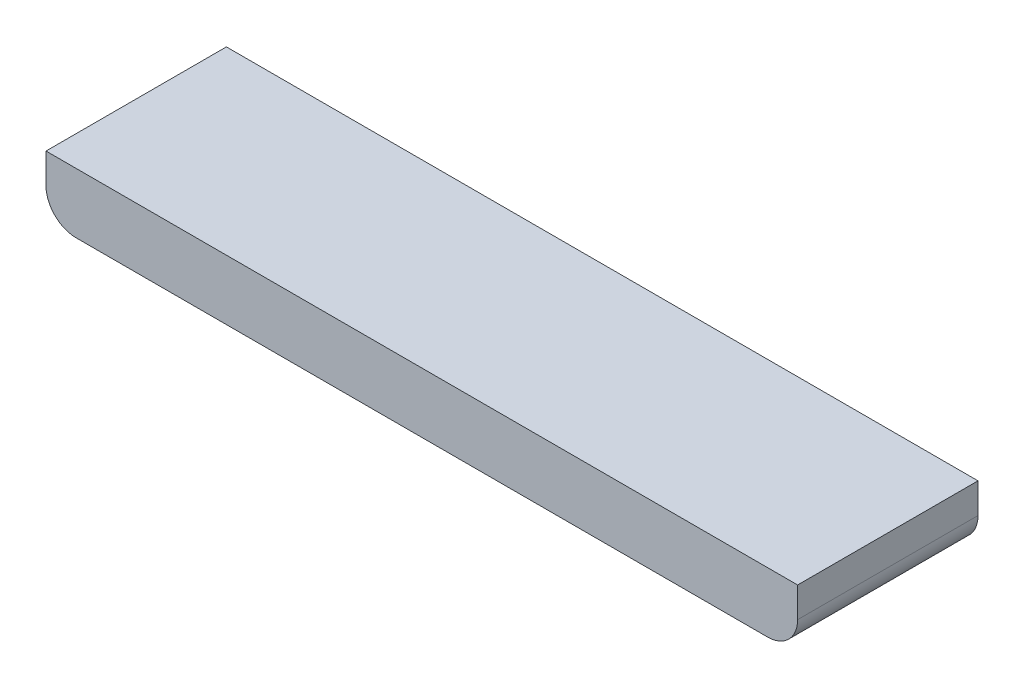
ISO-10303-21;
HEADER;
FILE_DESCRIPTION(('STEP AP214'),'2;1');
FILE_NAME('part.step','',(''),(''),'','','');
FILE_SCHEMA(('AUTOMOTIVE_DESIGN { 1 0 10303 214 1 1 1 1 }'));
ENDSEC;
DATA;
#1=APPLICATION_CONTEXT('core data for automotive mechanical design processes');
#2=APPLICATION_PROTOCOL_DEFINITION('international standard','automotive_design',2000,#1);
#3=PRODUCT_CONTEXT('',#1,'mechanical');
#4=PRODUCT('Part','Part','',(#3));
#5=PRODUCT_RELATED_PRODUCT_CATEGORY('part','',(#4));
#6=PRODUCT_DEFINITION_FORMATION('','',#4);
#7=PRODUCT_DEFINITION_CONTEXT('part definition',#1,'design');
#8=PRODUCT_DEFINITION('design','',#6,#7);
#9=PRODUCT_DEFINITION_SHAPE('','',#8);
#10=(LENGTH_UNIT() NAMED_UNIT(*) SI_UNIT(.MILLI.,.METRE.));
#11=(NAMED_UNIT(*) PLANE_ANGLE_UNIT() SI_UNIT($,.RADIAN.));
#12=(NAMED_UNIT(*) SI_UNIT($,.STERADIAN.) SOLID_ANGLE_UNIT());
#13=UNCERTAINTY_MEASURE_WITH_UNIT(LENGTH_MEASURE(1.E-05),#10,'distance_accuracy_value','');
#14=(GEOMETRIC_REPRESENTATION_CONTEXT(3) GLOBAL_UNCERTAINTY_ASSIGNED_CONTEXT((#13)) GLOBAL_UNIT_ASSIGNED_CONTEXT((#10,
#11,#12)) REPRESENTATION_CONTEXT('',''));
#15=CARTESIAN_POINT('',(0.,0.,0.));
#16=DIRECTION('',(0.,0.,1.));
#17=DIRECTION('',(1.,0.,0.));
#18=AXIS2_PLACEMENT_3D('',#15,#16,#17);
#19=CARTESIAN_POINT('',(250.,20.,-60.));
#20=DIRECTION('',(1.,0.,0.));
#21=DIRECTION('',(0.,0.,-1.));
#22=AXIS2_PLACEMENT_3D('',#19,#20,#21);
#23=PLANE('',#22);
#24=DIRECTION('',(0.,1.,0.));
#25=VECTOR('',#24,1.);
#26=CARTESIAN_POINT('',(250.,20.,60.));
#27=LINE('',#26,#25);
#28=CARTESIAN_POINT('',(250.,0.,60.));
#29=VERTEX_POINT('',#28);
#30=CARTESIAN_POINT('',(250.,20.,60.));
#31=VERTEX_POINT('',#30);
#32=EDGE_CURVE('E83',#29,#31,#27,.T.);
#33=ORIENTED_EDGE('',*,*,#32,.F.);
#34=DIRECTION('',(0.,0.,1.));
#35=VECTOR('',#34,1.);
#36=CARTESIAN_POINT('',(250.,0.,-60.));
#37=LINE('',#36,#35);
#38=CARTESIAN_POINT('',(250.,0.,-60.));
#39=VERTEX_POINT('',#38);
#40=EDGE_CURVE('E123',#29,#39,#37,.F.);
#41=ORIENTED_EDGE('',*,*,#40,.T.);
#42=DIRECTION('',(0.,1.,0.));
#43=VECTOR('',#42,1.);
#44=CARTESIAN_POINT('',(250.,20.,-60.));
#45=LINE('',#44,#43);
#46=CARTESIAN_POINT('',(250.,20.,-60.));
#47=VERTEX_POINT('',#46);
#48=EDGE_CURVE('E97',#39,#47,#45,.T.);
#49=ORIENTED_EDGE('',*,*,#48,.T.);
#50=DIRECTION('',(0.,0.,1.));
#51=VECTOR('',#50,1.);
#52=CARTESIAN_POINT('',(250.,20.,-60.));
#53=LINE('',#52,#51);
#54=EDGE_CURVE('E95',#47,#31,#53,.T.);
#55=ORIENTED_EDGE('',*,*,#54,.T.);
#56=EDGE_LOOP('',(#33,#41,#49,#55));
#57=FACE_BOUND('',#56,.T.);
#58=ADVANCED_FACE('F33',(#57),#23,.T.);
#59=CARTESIAN_POINT('',(-250.,-20.,-60.));
#60=DIRECTION('',(0.,-1.,0.));
#61=DIRECTION('',(0.,0.,-1.));
#62=AXIS2_PLACEMENT_3D('',#59,#60,#61);
#63=PLANE('',#62);
#64=DIRECTION('',(1.,0.,0.));
#65=VECTOR('',#64,1.);
#66=CARTESIAN_POINT('',(-250.,-20.,60.));
#67=LINE('',#66,#65);
#68=CARTESIAN_POINT('',(-230.,-20.,60.));
#69=VERTEX_POINT('',#68);
#70=CARTESIAN_POINT('',(230.,-20.,60.));
#71=VERTEX_POINT('',#70);
#72=EDGE_CURVE('E107',#69,#71,#67,.T.);
#73=ORIENTED_EDGE('',*,*,#72,.F.);
#74=DIRECTION('',(0.,0.,1.));
#75=VECTOR('',#74,1.);
#76=CARTESIAN_POINT('',(-230.,-20.,-60.));
#77=LINE('',#76,#75);
#78=CARTESIAN_POINT('',(-230.,-20.,-60.));
#79=VERTEX_POINT('',#78);
#80=EDGE_CURVE('E41',#69,#79,#77,.F.);
#81=ORIENTED_EDGE('',*,*,#80,.T.);
#82=DIRECTION('',(1.,0.,0.));
#83=VECTOR('',#82,1.);
#84=CARTESIAN_POINT('',(-250.,-20.,-60.));
#85=LINE('',#84,#83);
#86=CARTESIAN_POINT('',(230.,-20.,-60.));
#87=VERTEX_POINT('',#86);
#88=EDGE_CURVE('E102',#79,#87,#85,.T.);
#89=ORIENTED_EDGE('',*,*,#88,.T.);
#90=DIRECTION('',(0.,0.,1.));
#91=VECTOR('',#90,1.);
#92=CARTESIAN_POINT('',(230.,-20.,-60.));
#93=LINE('',#92,#91);
#94=EDGE_CURVE('E118',#87,#71,#93,.T.);
#95=ORIENTED_EDGE('',*,*,#94,.T.);
#96=EDGE_LOOP('',(#73,#81,#89,#95));
#97=FACE_BOUND('',#96,.T.);
#98=ADVANCED_FACE('F141',(#97),#63,.T.);
#99=CARTESIAN_POINT('',(-250.,20.,-60.));
#100=DIRECTION('',(-1.,0.,0.));
#101=DIRECTION('',(0.,0.,1.));
#102=AXIS2_PLACEMENT_3D('',#99,#100,#101);
#103=PLANE('',#102);
#104=DIRECTION('',(0.,-1.,0.));
#105=VECTOR('',#104,1.);
#106=CARTESIAN_POINT('',(-250.,20.,-60.));
#107=LINE('',#106,#105);
#108=CARTESIAN_POINT('',(-250.,20.,-60.));
#109=VERTEX_POINT('',#108);
#110=CARTESIAN_POINT('',(-250.,0.,-60.));
#111=VERTEX_POINT('',#110);
#112=EDGE_CURVE('E114',#109,#111,#107,.T.);
#113=ORIENTED_EDGE('',*,*,#112,.T.);
#114=DIRECTION('',(0.,0.,1.));
#115=VECTOR('',#114,1.);
#116=CARTESIAN_POINT('',(-250.,0.,-60.));
#117=LINE('',#116,#115);
#118=CARTESIAN_POINT('',(-250.,0.,60.));
#119=VERTEX_POINT('',#118);
#120=EDGE_CURVE('E128',#111,#119,#117,.T.);
#121=ORIENTED_EDGE('',*,*,#120,.T.);
#122=DIRECTION('',(0.,-1.,0.));
#123=VECTOR('',#122,1.);
#124=CARTESIAN_POINT('',(-250.,20.,60.));
#125=LINE('',#124,#123);
#126=CARTESIAN_POINT('',(-250.,20.,60.));
#127=VERTEX_POINT('',#126);
#128=EDGE_CURVE('E105',#127,#119,#125,.T.);
#129=ORIENTED_EDGE('',*,*,#128,.F.);
#130=DIRECTION('',(0.,0.,1.));
#131=VECTOR('',#130,1.);
#132=CARTESIAN_POINT('',(-250.,20.,-60.));
#133=LINE('',#132,#131);
#134=EDGE_CURVE('E101',#109,#127,#133,.T.);
#135=ORIENTED_EDGE('',*,*,#134,.F.);
#136=EDGE_LOOP('',(#113,#121,#129,#135));
#137=FACE_BOUND('',#136,.T.);
#138=ADVANCED_FACE('F133',(#137),#103,.T.);
#139=CARTESIAN_POINT('',(-250.,20.,-60.));
#140=DIRECTION('',(0.,1.,0.));
#141=DIRECTION('',(0.,0.,1.));
#142=AXIS2_PLACEMENT_3D('',#139,#140,#141);
#143=PLANE('',#142);
#144=ORIENTED_EDGE('',*,*,#134,.T.);
#145=DIRECTION('',(-1.,0.,0.));
#146=VECTOR('',#145,1.);
#147=CARTESIAN_POINT('',(-250.,20.,60.));
#148=LINE('',#147,#146);
#149=EDGE_CURVE('E87',#31,#127,#148,.T.);
#150=ORIENTED_EDGE('',*,*,#149,.F.);
#151=ORIENTED_EDGE('',*,*,#54,.F.);
#152=DIRECTION('',(-1.,0.,0.));
#153=VECTOR('',#152,1.);
#154=CARTESIAN_POINT('',(-250.,20.,-60.));
#155=LINE('',#154,#153);
#156=EDGE_CURVE('E112',#47,#109,#155,.T.);
#157=ORIENTED_EDGE('',*,*,#156,.T.);
#158=EDGE_LOOP('',(#144,#150,#151,#157));
#159=FACE_BOUND('',#158,.T.);
#160=ADVANCED_FACE('F104',(#159),#143,.T.);
#161=CARTESIAN_POINT('',(0.,0.,-60.));
#162=DIRECTION('',(0.,0.,1.));
#163=DIRECTION('',(1.,0.,0.));
#164=AXIS2_PLACEMENT_3D('',#161,#162,#163);
#165=PLANE('',#164);
#166=ORIENTED_EDGE('',*,*,#88,.F.);
#167=CARTESIAN_POINT('',(-230.,0.,-60.));
#168=DIRECTION('',(0.,0.,1.));
#169=DIRECTION('',(1.,0.,0.));
#170=AXIS2_PLACEMENT_3D('',#167,#168,#169);
#171=CIRCLE('',#170,20.);
#172=EDGE_CURVE('E11',#79,#111,#171,.F.);
#173=ORIENTED_EDGE('',*,*,#172,.T.);
#174=ORIENTED_EDGE('',*,*,#112,.F.);
#175=ORIENTED_EDGE('',*,*,#156,.F.);
#176=ORIENTED_EDGE('',*,*,#48,.F.);
#177=CARTESIAN_POINT('',(230.,0.,-60.));
#178=DIRECTION('',(0.,0.,1.));
#179=DIRECTION('',(1.,0.,0.));
#180=AXIS2_PLACEMENT_3D('',#177,#178,#179);
#181=CIRCLE('',#180,20.);
#182=EDGE_CURVE('E125',#39,#87,#181,.F.);
#183=ORIENTED_EDGE('',*,*,#182,.T.);
#184=EDGE_LOOP('',(#166,#173,#174,#175,#176,#183));
#185=FACE_BOUND('',#184,.T.);
#186=ADVANCED_FACE('F138',(#185),#165,.F.);
#187=CARTESIAN_POINT('',(0.,0.,60.));
#188=DIRECTION('',(0.,0.,1.));
#189=DIRECTION('',(1.,0.,0.));
#190=AXIS2_PLACEMENT_3D('',#187,#188,#189);
#191=PLANE('',#190);
#192=ORIENTED_EDGE('',*,*,#128,.T.);
#193=CARTESIAN_POINT('',(-230.,0.,60.));
#194=DIRECTION('',(0.,0.,1.));
#195=DIRECTION('',(1.,0.,0.));
#196=AXIS2_PLACEMENT_3D('',#193,#194,#195);
#197=CIRCLE('',#196,20.);
#198=EDGE_CURVE('E55',#119,#69,#197,.T.);
#199=ORIENTED_EDGE('',*,*,#198,.T.);
#200=ORIENTED_EDGE('',*,*,#72,.T.);
#201=CARTESIAN_POINT('',(230.,0.,60.));
#202=DIRECTION('',(0.,0.,1.));
#203=DIRECTION('',(1.,0.,0.));
#204=AXIS2_PLACEMENT_3D('',#201,#202,#203);
#205=CIRCLE('',#204,20.);
#206=EDGE_CURVE('E90',#71,#29,#205,.T.);
#207=ORIENTED_EDGE('',*,*,#206,.T.);
#208=ORIENTED_EDGE('',*,*,#32,.T.);
#209=ORIENTED_EDGE('',*,*,#149,.T.);
#210=EDGE_LOOP('',(#192,#199,#200,#207,#208,#209));
#211=FACE_BOUND('',#210,.T.);
#212=ADVANCED_FACE('F85',(#211),#191,.T.);
#213=CARTESIAN_POINT('',(230.,0.,-60.));
#214=DIRECTION('',(0.,0.,1.));
#215=DIRECTION('',(1.,0.,0.));
#216=AXIS2_PLACEMENT_3D('',#213,#214,#215);
#217=CYLINDRICAL_SURFACE('',#216,20.);
#218=ORIENTED_EDGE('',*,*,#182,.F.);
#219=ORIENTED_EDGE('',*,*,#40,.F.);
#220=ORIENTED_EDGE('',*,*,#206,.F.);
#221=ORIENTED_EDGE('',*,*,#94,.F.);
#222=EDGE_LOOP('',(#218,#219,#220,#221));
#223=FACE_BOUND('',#222,.T.);
#224=ADVANCED_FACE('F143',(#223),#217,.T.);
#225=CARTESIAN_POINT('',(-230.,0.,-60.));
#226=DIRECTION('',(0.,0.,1.));
#227=DIRECTION('',(1.,0.,0.));
#228=AXIS2_PLACEMENT_3D('',#225,#226,#227);
#229=CYLINDRICAL_SURFACE('',#228,20.);
#230=ORIENTED_EDGE('',*,*,#172,.F.);
#231=ORIENTED_EDGE('',*,*,#80,.F.);
#232=ORIENTED_EDGE('',*,*,#198,.F.);
#233=ORIENTED_EDGE('',*,*,#120,.F.);
#234=EDGE_LOOP('',(#230,#231,#232,#233));
#235=FACE_BOUND('',#234,.T.);
#236=ADVANCED_FACE('F35',(#235),#229,.T.);
#237=CLOSED_SHELL('',(#58,#98,#138,#160,#186,#212,#224,#236));
#238=MANIFOLD_SOLID_BREP('B2',#237);
#239=ADVANCED_BREP_SHAPE_REPRESENTATION('',(#18,#238),#14);
#240=SHAPE_DEFINITION_REPRESENTATION(#9,#239);
ENDSEC;
END-ISO-10303-21;
